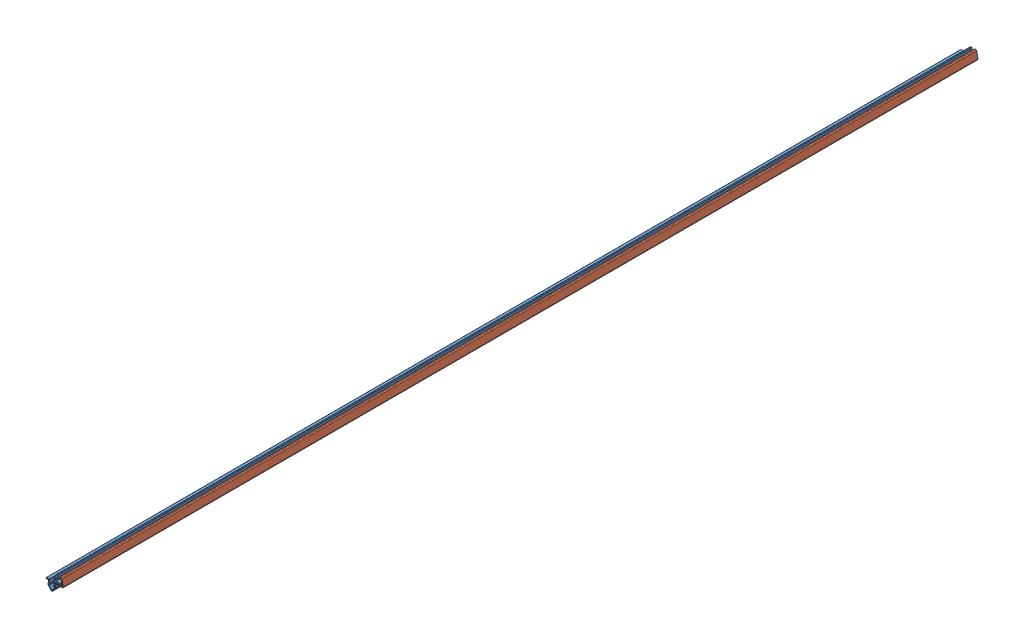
SolidWorks assembly J3PCN.SLDASM, configuration Default (file format 7000). Lengths in mm.
Overall size (18.87 18.05 1000).
2 component instances, 2 part files, 3 mates.
Components (placement in the parent):
- J3PCN-1-1: J3PCN-1.SLDPRT [ﾃﾞﾌｫﾙﾄ] at origin size (16.9 18.05 1000)
- J3PCN-2-1: J3PCN-2.SLDPRT [ﾃﾞﾌｫﾙﾄ] at (0.8797 -3 0) size (7.71 9 1000)
Mates (geometry in assembly coordinates):
- 一致2: coincident: plane of J3PCN-1-1 through (-2.1479 3.1 1000) normal (0 0 1); plane of J3PCN-2-1 through (3.4655 -2.52 1000) normal (0 0 1)
- 一致5: coincident: plane of J3PCN-1-1 through (2.3183 -1.2 1000) normal (0.707107 -0.707107 0); plane of J3PCN-2-1 through (2.3183 -1.2 1000) normal (-0.707107 0.707107 0)
- 一致6: coincident anti-aligned: plane of J3PCN-1-1 through (2.3183 -1.2 1000) normal (-0.970143 -0.242536 0); plane of J3PCN-2-1 through (2.3183 -1.2 1000) normal (0.970143 0.242536 0)
